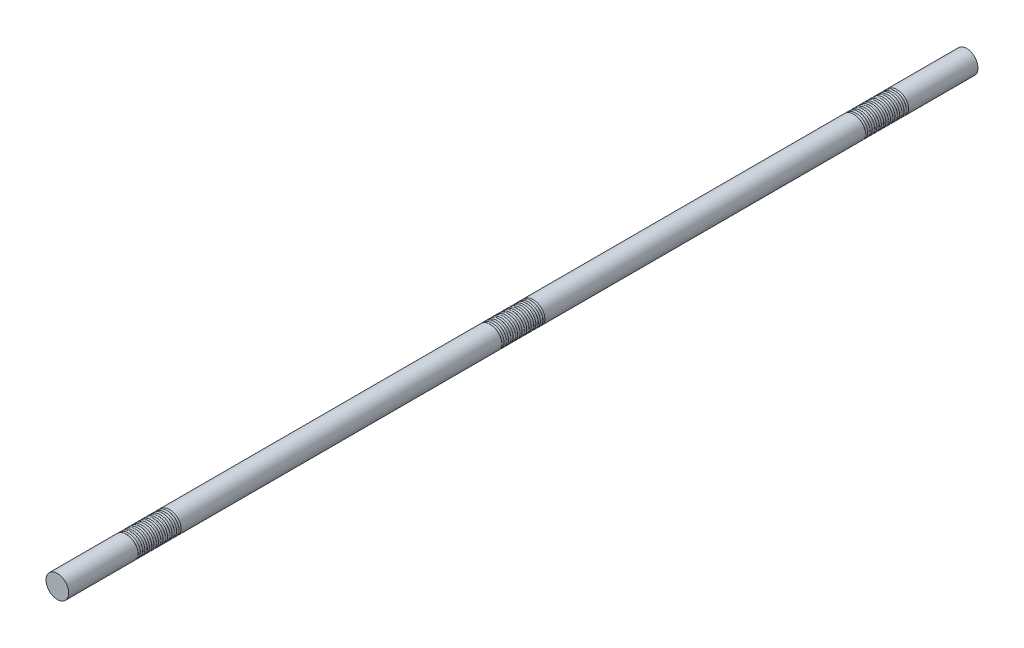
from build123d import *

# Parameters (mm, degrees)
SKETCH1_R              = 25
BOSS_EXTRUDE1_DEPTH    = 2000
CUT_SWEEP1_PITCH       = 10
CUT_SWEEP1_HEIGHT      = 100
CUT_SWEEP1_RADIUS      = 27.116666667
CUT_SWEEP1_START_ANGLE = -180
SKETCH3_R              = 3.175
LPATTERN1_COUNT        = 3
LPATTERN1_PITCH        = 800


with BuildPart() as part:
    # Sketch1 → Boss-Extrude1 (new body)
    with BuildSketch(Plane.XY):
        Circle(SKETCH1_R)
    extrude(amount=BOSS_EXTRUDE1_DEPTH)

    # Cut-Sweep1: sweep along a helix
    with BuildLine() as cut_sweep1_path:
        add(Helix(CUT_SWEEP1_PITCH, CUT_SWEEP1_HEIGHT, CUT_SWEEP1_RADIUS, center=(0, 0, 150), direction=(0, 0, 1), mode=Mode.PRIVATE).rotate(Axis((0, 0, 150), (0, 0, 1)), CUT_SWEEP1_START_ANGLE))
    # Sketch3 → Cut-Sweep1 (sweep, cut)
    with BuildSketch(Plane(origin=(0, 0, 0), x_dir=(1, 0, 0), z_dir=(0, 1, 0))):
        with Locations((-27.116666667, -150)):
            Circle(SKETCH3_R)
    cut_sweep1 = sweep(path=cut_sweep1_path.line, is_frenet=True, mode=Mode.SUBTRACT)

    # LPattern1: Cut-Sweep1 ×3
    with Locations(*[(0, 0, i * LPATTERN1_PITCH) for i in range(1, LPATTERN1_COUNT)]):
        add(cut_sweep1, mode=Mode.SUBTRACT)


solid = part.part
